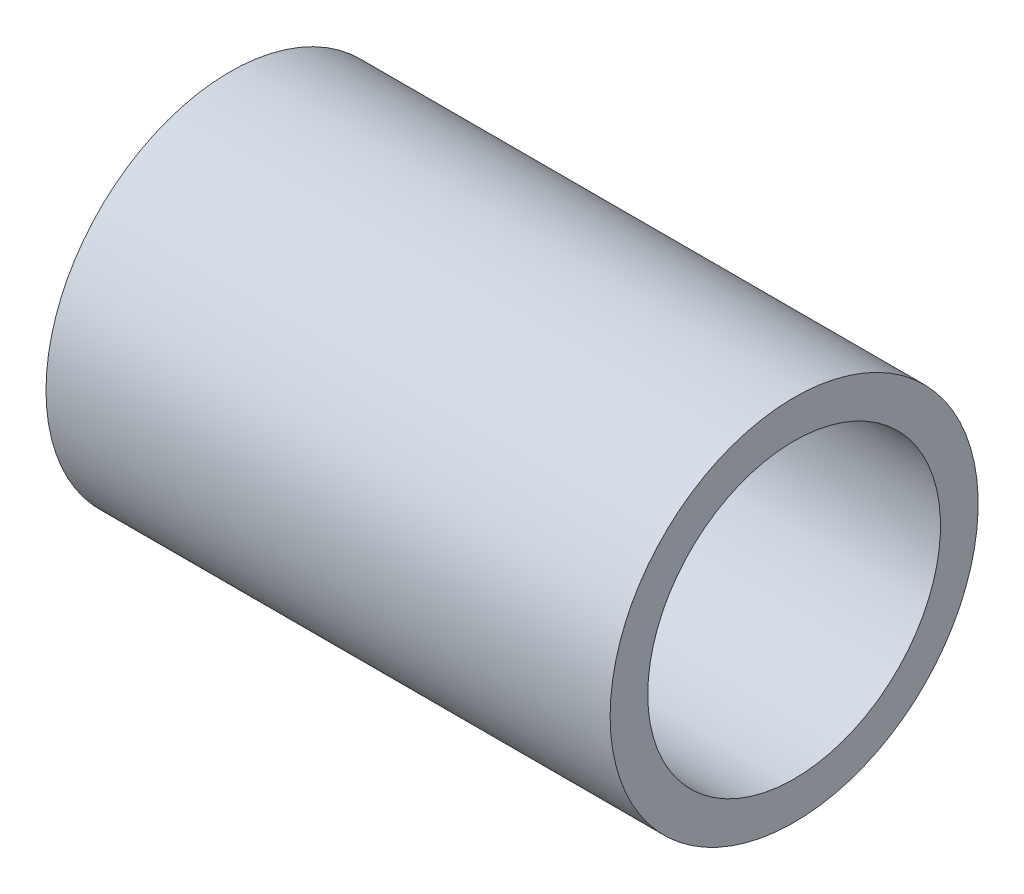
ISO-10303-21;
HEADER;
FILE_DESCRIPTION(('STEP AP214'),'2;1');
FILE_NAME('part.step','',(''),(''),'','','');
FILE_SCHEMA(('AUTOMOTIVE_DESIGN { 1 0 10303 214 1 1 1 1 }'));
ENDSEC;
DATA;
#1=APPLICATION_CONTEXT('core data for automotive mechanical design processes');
#2=APPLICATION_PROTOCOL_DEFINITION('international standard','automotive_design',2000,#1);
#3=PRODUCT_CONTEXT('',#1,'mechanical');
#4=PRODUCT('Part','Part','',(#3));
#5=PRODUCT_RELATED_PRODUCT_CATEGORY('part','',(#4));
#6=PRODUCT_DEFINITION_FORMATION('','',#4);
#7=PRODUCT_DEFINITION_CONTEXT('part definition',#1,'design');
#8=PRODUCT_DEFINITION('design','',#6,#7);
#9=PRODUCT_DEFINITION_SHAPE('','',#8);
#10=(LENGTH_UNIT() NAMED_UNIT(*) SI_UNIT(.MILLI.,.METRE.));
#11=(NAMED_UNIT(*) PLANE_ANGLE_UNIT() SI_UNIT($,.RADIAN.));
#12=(NAMED_UNIT(*) SI_UNIT($,.STERADIAN.) SOLID_ANGLE_UNIT());
#13=UNCERTAINTY_MEASURE_WITH_UNIT(LENGTH_MEASURE(1.E-05),#10,'distance_accuracy_value','');
#14=(GEOMETRIC_REPRESENTATION_CONTEXT(3) GLOBAL_UNCERTAINTY_ASSIGNED_CONTEXT((#13)) GLOBAL_UNIT_ASSIGNED_CONTEXT((#10,
#11,#12)) REPRESENTATION_CONTEXT('',''));
#15=CARTESIAN_POINT('',(0.,0.,0.));
#16=DIRECTION('',(0.,0.,1.));
#17=DIRECTION('',(1.,0.,0.));
#18=AXIS2_PLACEMENT_3D('',#15,#16,#17);
#19=CARTESIAN_POINT('',(-20.7518,0.,0.));
#20=DIRECTION('',(-1.,0.,0.));
#21=DIRECTION('',(0.,0.,1.));
#22=AXIS2_PLACEMENT_3D('',#19,#20,#21);
#23=CYLINDRICAL_SURFACE('',#22,13.5382);
#24=CARTESIAN_POINT('',(20.7518,0.,0.));
#25=DIRECTION('',(-1.,0.,0.));
#26=DIRECTION('',(0.,0.,1.));
#27=AXIS2_PLACEMENT_3D('',#24,#25,#26);
#28=CIRCLE('',#27,13.5382);
#29=CARTESIAN_POINT('',(20.7518,0.,13.5382));
#30=VERTEX_POINT('',#29);
#31=EDGE_CURVE('E63',#30,#30,#28,.T.);
#32=ORIENTED_EDGE('',*,*,#31,.T.);
#33=EDGE_LOOP('',(#32));
#34=FACE_BOUND('',#33,.T.);
#35=CARTESIAN_POINT('',(-20.7518,0.,0.));
#36=DIRECTION('',(-1.,0.,0.));
#37=DIRECTION('',(0.,0.,1.));
#38=AXIS2_PLACEMENT_3D('',#35,#36,#37);
#39=CIRCLE('',#38,13.5382);
#40=CARTESIAN_POINT('',(-20.7518,0.,13.5382));
#41=VERTEX_POINT('',#40);
#42=EDGE_CURVE('E10',#41,#41,#39,.T.);
#43=ORIENTED_EDGE('',*,*,#42,.F.);
#44=EDGE_LOOP('',(#43));
#45=FACE_BOUND('',#44,.T.);
#46=ADVANCED_FACE('F35',(#34,#45),#23,.T.);
#47=CARTESIAN_POINT('',(-20.7518,-13.5382,0.));
#48=DIRECTION('',(-1.,0.,0.));
#49=DIRECTION('',(0.,0.,1.));
#50=AXIS2_PLACEMENT_3D('',#47,#48,#49);
#51=PLANE('',#50);
#52=ORIENTED_EDGE('',*,*,#42,.T.);
#53=EDGE_LOOP('',(#52));
#54=FACE_BOUND('',#53,.T.);
#55=CARTESIAN_POINT('',(-20.7518,0.,0.));
#56=DIRECTION('',(-1.,0.,0.));
#57=DIRECTION('',(0.,0.,1.));
#58=AXIS2_PLACEMENT_3D('',#55,#56,#57);
#59=CIRCLE('',#58,10.7696);
#60=CARTESIAN_POINT('',(-20.7518,0.,10.7696));
#61=VERTEX_POINT('',#60);
#62=EDGE_CURVE('E41',#61,#61,#59,.T.);
#63=ORIENTED_EDGE('',*,*,#62,.F.);
#64=EDGE_LOOP('',(#63));
#65=FACE_BOUND('',#64,.T.);
#66=ADVANCED_FACE('F81',(#54,#65),#51,.T.);
#67=CARTESIAN_POINT('',(-1.1938,0.,0.));
#68=DIRECTION('',(-1.,0.,0.));
#69=DIRECTION('',(0.,0.,1.));
#70=AXIS2_PLACEMENT_3D('',#67,#68,#69);
#71=CONICAL_SURFACE('',#70,10.6172,0.00779205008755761);
#72=ORIENTED_EDGE('',*,*,#62,.T.);
#73=EDGE_LOOP('',(#72));
#74=FACE_BOUND('',#73,.T.);
#75=CARTESIAN_POINT('',(-1.1938,0.,0.));
#76=DIRECTION('',(-1.,0.,0.));
#77=DIRECTION('',(0.,0.,1.));
#78=AXIS2_PLACEMENT_3D('',#75,#76,#77);
#79=CIRCLE('',#78,10.6172);
#80=CARTESIAN_POINT('',(-1.1938,0.,10.6172));
#81=VERTEX_POINT('',#80);
#82=EDGE_CURVE('E45',#81,#81,#79,.T.);
#83=ORIENTED_EDGE('',*,*,#82,.F.);
#84=EDGE_LOOP('',(#83));
#85=FACE_BOUND('',#84,.T.);
#86=ADVANCED_FACE('F85',(#74,#85),#71,.F.);
#87=CARTESIAN_POINT('',(-1.1938,-10.6172,0.));
#88=DIRECTION('',(-1.,0.,0.));
#89=DIRECTION('',(0.,0.,1.));
#90=AXIS2_PLACEMENT_3D('',#87,#88,#89);
#91=PLANE('',#90);
#92=ORIENTED_EDGE('',*,*,#82,.T.);
#93=EDGE_LOOP('',(#92));
#94=FACE_BOUND('',#93,.T.);
#95=CARTESIAN_POINT('',(-1.1938,0.,0.));
#96=DIRECTION('',(-1.,0.,0.));
#97=DIRECTION('',(0.,0.,1.));
#98=AXIS2_PLACEMENT_3D('',#95,#96,#97);
#99=CIRCLE('',#98,7.8994);
#100=CARTESIAN_POINT('',(-1.1938,0.,7.8994));
#101=VERTEX_POINT('',#100);
#102=EDGE_CURVE('E49',#101,#101,#99,.T.);
#103=ORIENTED_EDGE('',*,*,#102,.F.);
#104=EDGE_LOOP('',(#103));
#105=FACE_BOUND('',#104,.T.);
#106=ADVANCED_FACE('F89',(#94,#105),#91,.T.);
#107=CARTESIAN_POINT('',(-20.7518,0.,0.));
#108=DIRECTION('',(-1.,0.,0.));
#109=DIRECTION('',(0.,0.,1.));
#110=AXIS2_PLACEMENT_3D('',#107,#108,#109);
#111=CYLINDRICAL_SURFACE('',#110,7.8994);
#112=ORIENTED_EDGE('',*,*,#102,.T.);
#113=EDGE_LOOP('',(#112));
#114=FACE_BOUND('',#113,.T.);
#115=CARTESIAN_POINT('',(1.1938,0.,0.));
#116=DIRECTION('',(-1.,0.,0.));
#117=DIRECTION('',(0.,0.,1.));
#118=AXIS2_PLACEMENT_3D('',#115,#116,#117);
#119=CIRCLE('',#118,7.8994);
#120=CARTESIAN_POINT('',(1.1938,0.,7.8994));
#121=VERTEX_POINT('',#120);
#122=EDGE_CURVE('E54',#121,#121,#119,.T.);
#123=ORIENTED_EDGE('',*,*,#122,.F.);
#124=EDGE_LOOP('',(#123));
#125=FACE_BOUND('',#124,.T.);
#126=ADVANCED_FACE('F95',(#114,#125),#111,.F.);
#127=CARTESIAN_POINT('',(1.1938,-10.6172,0.));
#128=DIRECTION('',(1.,0.,0.));
#129=DIRECTION('',(0.,0.,-1.));
#130=AXIS2_PLACEMENT_3D('',#127,#128,#129);
#131=PLANE('',#130);
#132=ORIENTED_EDGE('',*,*,#122,.T.);
#133=EDGE_LOOP('',(#132));
#134=FACE_BOUND('',#133,.T.);
#135=CARTESIAN_POINT('',(1.1938,0.,0.));
#136=DIRECTION('',(-1.,0.,0.));
#137=DIRECTION('',(0.,0.,1.));
#138=AXIS2_PLACEMENT_3D('',#135,#136,#137);
#139=CIRCLE('',#138,10.6172);
#140=CARTESIAN_POINT('',(1.1938,0.,10.6172));
#141=VERTEX_POINT('',#140);
#142=EDGE_CURVE('E57',#141,#141,#139,.T.);
#143=ORIENTED_EDGE('',*,*,#142,.F.);
#144=EDGE_LOOP('',(#143));
#145=FACE_BOUND('',#144,.T.);
#146=ADVANCED_FACE('F77',(#134,#145),#131,.T.);
#147=CARTESIAN_POINT('',(20.7518,0.,0.));
#148=DIRECTION('',(1.,0.,0.));
#149=DIRECTION('',(0.,0.,-1.));
#150=AXIS2_PLACEMENT_3D('',#147,#148,#149);
#151=CONICAL_SURFACE('',#150,10.7696,0.00779205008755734);
#152=ORIENTED_EDGE('',*,*,#142,.T.);
#153=EDGE_LOOP('',(#152));
#154=FACE_BOUND('',#153,.T.);
#155=CARTESIAN_POINT('',(20.7518,0.,0.));
#156=DIRECTION('',(-1.,0.,0.));
#157=DIRECTION('',(0.,0.,1.));
#158=AXIS2_PLACEMENT_3D('',#155,#156,#157);
#159=CIRCLE('',#158,10.7696);
#160=CARTESIAN_POINT('',(20.7518,0.,10.7696));
#161=VERTEX_POINT('',#160);
#162=EDGE_CURVE('E60',#161,#161,#159,.T.);
#163=ORIENTED_EDGE('',*,*,#162,.F.);
#164=EDGE_LOOP('',(#163));
#165=FACE_BOUND('',#164,.T.);
#166=ADVANCED_FACE('F71',(#154,#165),#151,.F.);
#167=CARTESIAN_POINT('',(20.7518,-13.5382,0.));
#168=DIRECTION('',(1.,0.,0.));
#169=DIRECTION('',(0.,0.,-1.));
#170=AXIS2_PLACEMENT_3D('',#167,#168,#169);
#171=PLANE('',#170);
#172=ORIENTED_EDGE('',*,*,#162,.T.);
#173=EDGE_LOOP('',(#172));
#174=FACE_BOUND('',#173,.T.);
#175=ORIENTED_EDGE('',*,*,#31,.F.);
#176=EDGE_LOOP('',(#175));
#177=FACE_BOUND('',#176,.T.);
#178=ADVANCED_FACE('F69',(#174,#177),#171,.T.);
#179=CLOSED_SHELL('',(#46,#66,#86,#106,#126,#146,#166,#178));
#180=MANIFOLD_SOLID_BREP('B2',#179);
#181=ADVANCED_BREP_SHAPE_REPRESENTATION('',(#18,#180),#14);
#182=SHAPE_DEFINITION_REPRESENTATION(#9,#181);
ENDSEC;
END-ISO-10303-21;
